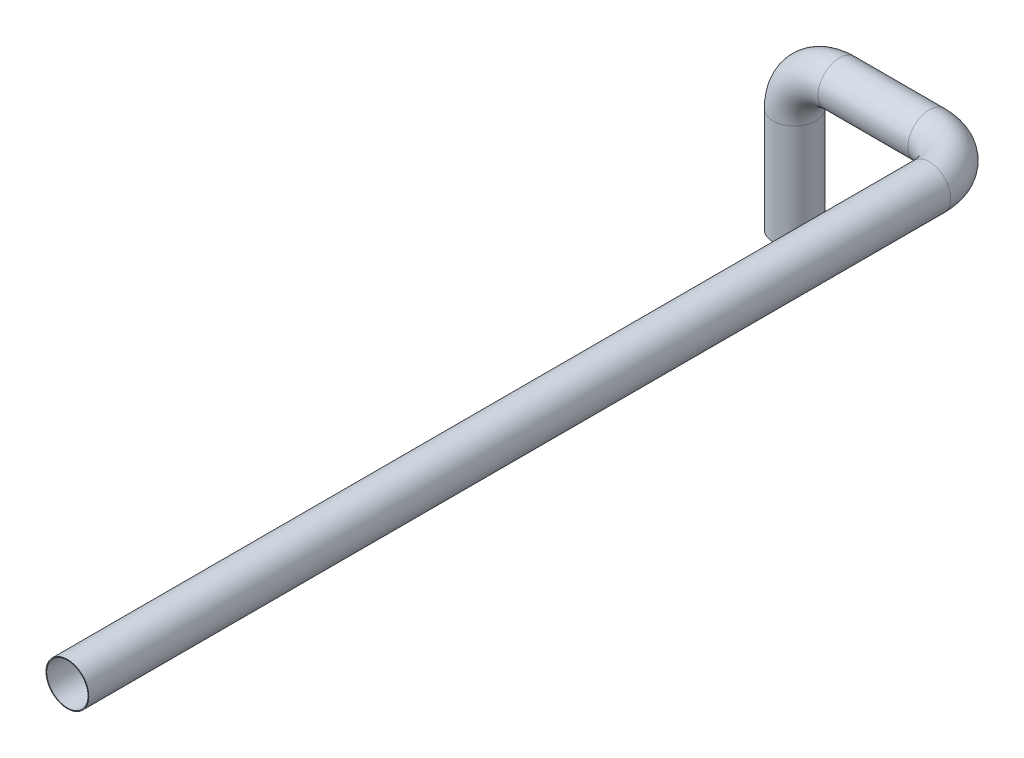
from build123d import *

# Parameters (mm, degrees)
CROQUIS5_R   = 14.3
CROQUIS5_R_2 = 13.8


with BuildPart() as part:
    # Barrer1: sweep along a curve in space
    with BuildLine() as barrer1_path:
        Line((120, 0, 30), (120, 0, 605.8))
        ThreePointArc((90, 0, 0), (111.213203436, 0, 8.786796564), (120, 0, 30))
        Line((30, 0, 0), (90, 0, 0))
        ThreePointArc((30, 0, 0), (8.786796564, -8.786796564, 0), (0, -30, 0))
        Line((0, -30, 0), (0, -100, 0))
    # Croquis5 → Barrer1 (sweep)
    with BuildSketch(Plane(origin=(120, 0, 605.8), x_dir=(1, 0, 0), z_dir=(0, 0, 1))):
        Circle(CROQUIS5_R)
        Circle(CROQUIS5_R_2, mode=Mode.SUBTRACT)
    sweep(path=barrer1_path.line)


solid = part.part
